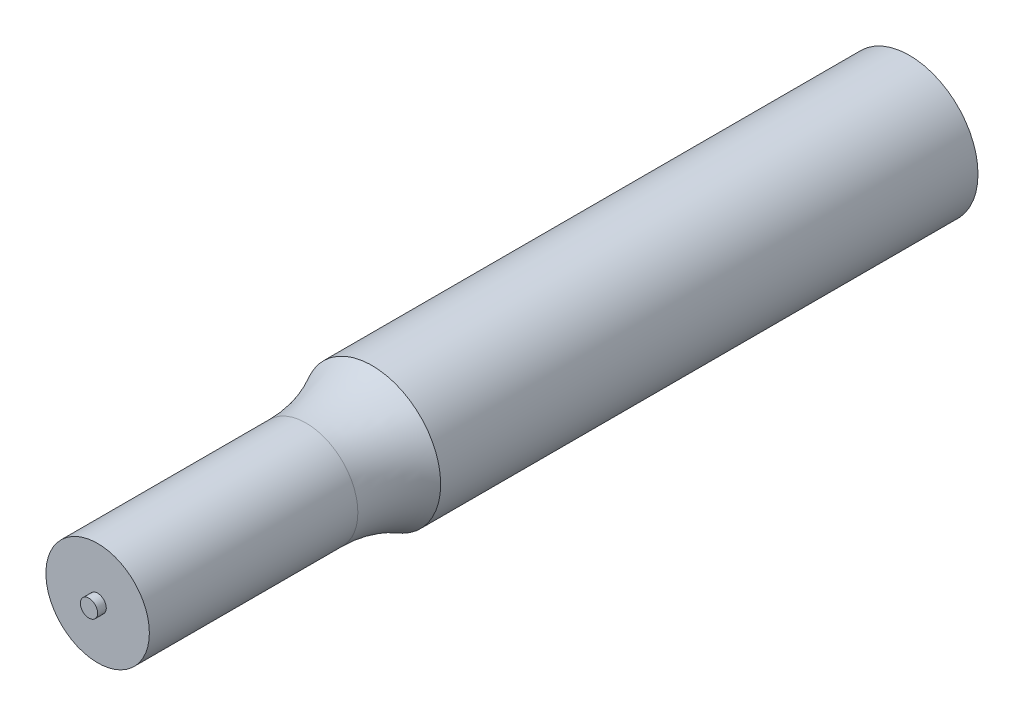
ISO-10303-21;
HEADER;
FILE_DESCRIPTION(('STEP AP214'),'2;1');
FILE_NAME('part.step','',(''),(''),'','','');
FILE_SCHEMA(('AUTOMOTIVE_DESIGN { 1 0 10303 214 1 1 1 1 }'));
ENDSEC;
DATA;
#1=APPLICATION_CONTEXT('core data for automotive mechanical design processes');
#2=APPLICATION_PROTOCOL_DEFINITION('international standard','automotive_design',2000,#1);
#3=PRODUCT_CONTEXT('',#1,'mechanical');
#4=PRODUCT('Part','Part','',(#3));
#5=PRODUCT_RELATED_PRODUCT_CATEGORY('part','',(#4));
#6=PRODUCT_DEFINITION_FORMATION('','',#4);
#7=PRODUCT_DEFINITION_CONTEXT('part definition',#1,'design');
#8=PRODUCT_DEFINITION('design','',#6,#7);
#9=PRODUCT_DEFINITION_SHAPE('','',#8);
#10=(LENGTH_UNIT() NAMED_UNIT(*) SI_UNIT(.MILLI.,.METRE.));
#11=(NAMED_UNIT(*) PLANE_ANGLE_UNIT() SI_UNIT($,.RADIAN.));
#12=(NAMED_UNIT(*) SI_UNIT($,.STERADIAN.) SOLID_ANGLE_UNIT());
#13=UNCERTAINTY_MEASURE_WITH_UNIT(LENGTH_MEASURE(1.E-05),#10,'distance_accuracy_value','');
#14=(GEOMETRIC_REPRESENTATION_CONTEXT(3) GLOBAL_UNCERTAINTY_ASSIGNED_CONTEXT((#13)) GLOBAL_UNIT_ASSIGNED_CONTEXT((#10,
#11,#12)) REPRESENTATION_CONTEXT('',''));
#15=CARTESIAN_POINT('',(0.,0.,0.));
#16=DIRECTION('',(0.,0.,1.));
#17=DIRECTION('',(1.,0.,0.));
#18=AXIS2_PLACEMENT_3D('',#15,#16,#17);
#19=CARTESIAN_POINT('',(-6.35,0.,6.35));
#20=DIRECTION('',(0.,0.,1.));
#21=DIRECTION('',(1.,0.,0.));
#22=AXIS2_PLACEMENT_3D('',#19,#20,#21);
#23=PLANE('',#22);
#24=CARTESIAN_POINT('',(0.,0.,6.35));
#25=DIRECTION('',(0.,0.,1.));
#26=DIRECTION('',(1.,0.,0.));
#27=AXIS2_PLACEMENT_3D('',#24,#25,#26);
#28=CIRCLE('',#27,6.35);
#29=CARTESIAN_POINT('',(6.35,0.,6.35));
#30=VERTEX_POINT('',#29);
#31=EDGE_CURVE('E64',#30,#30,#28,.T.);
#32=ORIENTED_EDGE('',*,*,#31,.F.);
#33=EDGE_LOOP('',(#32));
#34=FACE_BOUND('',#33,.T.);
#35=ADVANCED_FACE('F41',(#34),#23,.F.);
#36=CARTESIAN_POINT('',(0.,0.,43.5171681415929));
#37=DIRECTION('',(0.,0.,1.));
#38=DIRECTION('',(1.,0.,0.));
#39=AXIS2_PLACEMENT_3D('',#36,#37,#38);
#40=CYLINDRICAL_SURFACE('',#39,6.35);
#41=CARTESIAN_POINT('',(-4.84267088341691,-4.10743700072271,25.179099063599));
#42=CARTESIAN_POINT('',(-4.91031116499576,-4.02766520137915,24.7923213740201));
#43=CARTESIAN_POINT('',(-4.97622022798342,-3.94598660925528,24.4056305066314));
#44=CARTESIAN_POINT('',(-5.10457037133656,-3.77849789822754,23.6325148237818));
#45=CARTESIAN_POINT('',(-5.16701100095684,-3.69268724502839,23.246090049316));
#46=CARTESIAN_POINT('',(-5.28869128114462,-3.51621627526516,22.471853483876));
#47=CARTESIAN_POINT('',(-5.3479142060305,-3.42553473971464,22.0840438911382));
#48=CARTESIAN_POINT('',(-5.46281264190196,-3.23916217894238,21.3091382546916));
#49=CARTESIAN_POINT('',(-5.51848847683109,-3.1434716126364,20.9220421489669));
#50=CARTESIAN_POINT('',(-5.62775930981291,-2.94349561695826,20.1381975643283));
#51=CARTESIAN_POINT('',(-5.68125471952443,-2.83904602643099,19.7414769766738));
#52=CARTESIAN_POINT('',(-5.78445697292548,-2.62240574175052,18.9495188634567));
#53=CARTESIAN_POINT('',(-5.83416278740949,-2.51021296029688,18.5542817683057));
#54=CARTESIAN_POINT('',(-5.90576107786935,-2.33419370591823,17.9638277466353));
#55=CARTESIAN_POINT('',(-5.9291108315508,-2.27429911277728,17.7676144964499));
#56=CARTESIAN_POINT('',(-5.9748282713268,-2.15133460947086,17.3760731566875));
#57=CARTESIAN_POINT('',(-5.99719599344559,-2.08826481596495,17.1807450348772));
#58=CARTESIAN_POINT('',(-6.04091673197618,-1.95819561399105,16.7913811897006));
#59=CARTESIAN_POINT('',(-6.06227019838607,-1.89119797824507,16.5973449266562));
#60=CARTESIAN_POINT('',(-6.10393304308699,-1.75208332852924,16.2110122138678));
#61=CARTESIAN_POINT('',(-6.12424257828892,-1.67996708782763,16.0187155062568));
#62=CARTESIAN_POINT('',(-6.15380231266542,-1.56675228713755,15.7329471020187));
#63=CARTESIAN_POINT('',(-6.16347241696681,-1.52831758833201,15.63846410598));
#64=CARTESIAN_POINT('',(-6.1825245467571,-1.4493256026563,15.450339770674));
#65=CARTESIAN_POINT('',(-6.19190652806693,-1.40876799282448,15.3566985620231));
#66=CARTESIAN_POINT('',(-6.21036679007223,-1.32502361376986,15.1704738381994));
#67=CARTESIAN_POINT('',(-6.21944483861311,-1.28183490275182,15.0778911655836));
#68=CARTESIAN_POINT('',(-6.23725256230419,-1.19216789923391,14.8943241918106));
#69=CARTESIAN_POINT('',(-6.24598231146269,-1.1456903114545,14.8033395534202));
#70=CARTESIAN_POINT('',(-6.26502899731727,-1.03713912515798,14.6026879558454));
#71=CARTESIAN_POINT('',(-6.27524324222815,-0.973951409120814,14.4935938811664));
#72=CARTESIAN_POINT('',(-6.28993321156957,-0.872007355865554,14.3346767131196));
#73=CARTESIAN_POINT('',(-6.29471851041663,-0.836885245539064,14.2825598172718));
#74=CARTESIAN_POINT('',(-6.30403025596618,-0.76359266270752,14.1805061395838));
#75=CARTESIAN_POINT('',(-6.30855685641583,-0.725424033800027,14.1305680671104));
#76=CARTESIAN_POINT('',(-6.3167242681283,-0.650185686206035,14.0399236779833));
#77=CARTESIAN_POINT('',(-6.32040505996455,-0.613575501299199,13.9988438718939));
#78=CARTESIAN_POINT('',(-6.32741951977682,-0.536439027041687,13.9201768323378));
#79=CARTESIAN_POINT('',(-6.33075208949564,-0.495901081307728,13.8826006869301));
#80=CARTESIAN_POINT('',(-6.33694554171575,-0.409326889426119,13.8124695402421));
#81=CARTESIAN_POINT('',(-6.33979699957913,-0.363205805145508,13.7800155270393));
#82=CARTESIAN_POINT('',(-6.34463224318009,-0.265487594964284,13.7248093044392));
#83=CARTESIAN_POINT('',(-6.34662196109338,-0.213931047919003,13.7019907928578));
#84=CARTESIAN_POINT('',(-6.34875500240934,-0.129467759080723,13.6774958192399));
#85=CARTESIAN_POINT('',(-6.34932391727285,-0.097991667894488,13.6709525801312));
#86=CARTESIAN_POINT('',(-6.34998629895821,-0.0343716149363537,13.6633332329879));
#87=CARTESIAN_POINT('',(-6.35008005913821,-0.00222807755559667,13.6622537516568));
#88=CARTESIAN_POINT('',(-6.34978056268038,0.0617275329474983,13.6656997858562));
#89=CARTESIAN_POINT('',(-6.34938755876,0.0935397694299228,13.6702223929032));
#90=CARTESIAN_POINT('',(-6.34816036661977,0.156013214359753,13.6843262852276));
#91=CARTESIAN_POINT('',(-6.34732566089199,0.186673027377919,13.6939135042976));
#92=CARTESIAN_POINT('',(-6.34482209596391,0.260065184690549,13.7226150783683));
#93=CARTESIAN_POINT('',(-6.34294612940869,0.301858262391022,13.7440834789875));
#94=CARTESIAN_POINT('',(-6.33864739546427,0.38165159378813,13.793095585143));
#95=CARTESIAN_POINT('',(-6.33622323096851,0.419641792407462,13.8206548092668));
#96=CARTESIAN_POINT('',(-6.33048242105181,0.499390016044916,13.8856462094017));
#97=CARTESIAN_POINT('',(-6.32708403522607,0.540416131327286,13.9239538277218));
#98=CARTESIAN_POINT('',(-6.31991582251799,0.618632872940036,14.0043143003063));
#99=CARTESIAN_POINT('',(-6.31614532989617,0.655816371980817,14.0463738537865));
#100=CARTESIAN_POINT('',(-6.30831294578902,0.727315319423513,14.1332452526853));
#101=CARTESIAN_POINT('',(-6.30424941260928,0.761611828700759,14.1780723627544));
#102=CARTESIAN_POINT('',(-6.29591643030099,0.827671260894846,14.2694579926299));
#103=CARTESIAN_POINT('',(-6.29164716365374,0.859436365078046,14.3160149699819));
#104=CARTESIAN_POINT('',(-6.27903822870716,0.948507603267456,14.4526950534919));
#105=CARTESIAN_POINT('',(-6.27047768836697,1.00320772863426,14.5444903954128));
#106=CARTESIAN_POINT('',(-6.25289089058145,1.10753607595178,14.7308978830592));
#107=CARTESIAN_POINT('',(-6.24386430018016,1.15716059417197,14.8255120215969));
#108=CARTESIAN_POINT('',(-6.22540152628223,1.2526961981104,15.01681191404));
#109=CARTESIAN_POINT('',(-6.21596447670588,1.29859878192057,15.1135018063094));
#110=CARTESIAN_POINT('',(-6.1967416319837,1.38742561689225,15.3082116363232));
#111=CARTESIAN_POINT('',(-6.18695578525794,1.43034942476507,15.4062317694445));
#112=CARTESIAN_POINT('',(-6.15702657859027,1.55595508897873,15.7026425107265));
#113=CARTESIAN_POINT('',(-6.13639643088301,1.63504712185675,15.9025024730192));
#114=CARTESIAN_POINT('',(-6.0939967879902,1.78657264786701,16.3042250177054));
#115=CARTESIAN_POINT('',(-6.0722290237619,1.85901581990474,16.5060841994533));
#116=CARTESIAN_POINT('',(-6.03036939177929,1.99029543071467,16.8860423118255));
#117=CARTESIAN_POINT('',(-6.01040779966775,2.04970121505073,17.0639597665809));
#118=CARTESIAN_POINT('',(-5.9696550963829,2.1655203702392,17.4206719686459));
#119=CARTESIAN_POINT('',(-5.94886396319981,2.22193366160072,17.5994667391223));
#120=CARTESIAN_POINT('',(-5.88526310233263,2.38751102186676,18.1368946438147));
#121=CARTESIAN_POINT('',(-5.84123182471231,2.49299442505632,18.4965176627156));
#122=CARTESIAN_POINT('',(-5.74991915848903,2.69692067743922,19.2179005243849));
#123=CARTESIAN_POINT('',(-5.7026330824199,2.79535293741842,19.5796627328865));
#124=CARTESIAN_POINT('',(-5.60490949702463,2.98647037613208,20.3042400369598));
#125=CARTESIAN_POINT('',(-5.55447226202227,3.0791560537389,20.6670550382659));
#126=CARTESIAN_POINT('',(-5.45303116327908,3.25526543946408,21.3755236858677));
#127=CARTESIAN_POINT('',(-5.40217781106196,3.33892049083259,21.7211416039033));
#128=CARTESIAN_POINT('',(-5.29765509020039,3.50239341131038,22.4128681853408));
#129=CARTESIAN_POINT('',(-5.24398564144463,3.58221117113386,22.7589768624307));
#130=CARTESIAN_POINT('',(-5.13398766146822,3.73814880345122,23.4506312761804));
#131=CARTESIAN_POINT('',(-5.07766643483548,3.81427778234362,23.7961761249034));
#132=CARTESIAN_POINT('',(-4.9622484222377,3.96326100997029,24.487489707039));
#133=CARTESIAN_POINT('',(-4.90315177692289,4.03611542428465,24.8332584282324));
#134=CARTESIAN_POINT('',(-4.84267088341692,4.10743700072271,25.179099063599));
#135=B_SPLINE_CURVE_WITH_KNOTS('',3,(#41,#42,#43,#44,#45,#46,#47,#48,#49,#50,#51,#52,#53,#54,
#55,#56,#57,#58,#59,#60,#61,#62,#63,#64,#65,#66,#67,#68,#69,#70,#71,#72,#73,#74,#75,#76,#77,#78,
#79,#80,#81,#82,#83,#84,#85,#86,#87,#88,#89,#90,#91,#92,#93,#94,#95,#96,#97,#98,#99,#100,#101,
#102,#103,#104,#105,#106,#107,#108,#109,#110,#111,#112,#113,#114,#115,#116,#117,#118,#119,#120,
#121,#122,#123,#124,#125,#126,#127,#128,#129,#130,#131,#132,#133,#134),.UNSPECIFIED.,.F.,.F.,(4,
2,2,2,2,2,2,2,2,2,2,2,2,2,2,2,2,2,2,2,2,2,2,2,2,2,2,2,2,2,2,2,2,2,2,2,2,2,2,2,2,2,2,2,2,2,4),
(0.,1.20200424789,2.40416434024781,3.61207023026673,4.81986564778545,6.06093657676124,
7.3023433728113,7.92174916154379,8.54113220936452,9.16023783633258,9.77925013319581,
10.0866059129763,10.3940085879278,10.7016409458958,11.0092075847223,11.3882604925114,
11.5772698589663,11.7661657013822,11.9314380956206,12.0972169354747,12.2659389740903,
12.4334803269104,12.5295220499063,12.6255044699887,12.7214370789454,12.8174823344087,
12.9577382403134,13.0983557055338,13.2666724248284,13.4352959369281,13.6049511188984,
13.7744584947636,14.0957863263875,14.4173469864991,14.7396226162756,15.0619461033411,
15.7095337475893,16.3561632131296,16.9220256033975,17.4879030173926,18.6198287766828,
19.7534202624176,20.8869132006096,21.9645270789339,23.0421716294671,24.1170039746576,
25.1917819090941),.UNSPECIFIED.);
#136=CARTESIAN_POINT('',(-4.84270585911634,-4.10739576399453,25.178899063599));
#137=VERTEX_POINT('',#136);
#138=CARTESIAN_POINT('',(-4.84270585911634,4.10739576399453,25.178899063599));
#139=VERTEX_POINT('',#138);
#140=EDGE_CURVE('E53',#137,#139,#135,.T.);
#141=ORIENTED_EDGE('',*,*,#140,.T.);
#142=CARTESIAN_POINT('',(-4.84274083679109,4.10735452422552,25.178699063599));
#143=CARTESIAN_POINT('',(-4.82778505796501,4.12498432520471,25.2642011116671));
#144=CARTESIAN_POINT('',(-4.81391554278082,4.14114605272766,25.3501839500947));
#145=CARTESIAN_POINT('',(-4.78843682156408,4.17058235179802,25.5229713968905));
#146=CARTESIAN_POINT('',(-4.77682752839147,4.18385703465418,25.6097759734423));
#147=CARTESIAN_POINT('',(-4.74552601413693,4.21941907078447,25.8711726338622));
#148=CARTESIAN_POINT('',(-4.72935149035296,4.23745445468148,26.0467967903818));
#149=CARTESIAN_POINT('',(-4.70687228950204,4.26240911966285,26.3992920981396));
#150=CARTESIAN_POINT('',(-4.70055959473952,4.2693374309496,26.5761621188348));
#151=CARTESIAN_POINT('',(-4.69795117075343,4.27220782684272,26.9300713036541));
#152=CARTESIAN_POINT('',(-4.70165544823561,4.26814990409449,27.1071104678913));
#153=CARTESIAN_POINT('',(-4.71897998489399,4.24898741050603,27.4601380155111));
#154=CARTESIAN_POINT('',(-4.73260227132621,4.23388058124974,27.6361261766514));
#155=CARTESIAN_POINT('',(-4.76937959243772,4.19240808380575,27.9857641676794));
#156=CARTESIAN_POINT('',(-4.7925344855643,4.16604258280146,28.1594140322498));
#157=CARTESIAN_POINT('',(-4.84774007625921,4.10167211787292,28.5032635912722));
#158=CARTESIAN_POINT('',(-4.87979819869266,4.06365743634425,28.6734602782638));
#159=CARTESIAN_POINT('',(-4.95186919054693,3.97551642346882,29.0089658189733));
#160=CARTESIAN_POINT('',(-4.99188180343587,3.9253904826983,29.174274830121));
#161=CARTESIAN_POINT('',(-5.07839446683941,3.81279638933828,29.4976725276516));
#162=CARTESIAN_POINT('',(-5.12485267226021,3.7504068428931,29.6557996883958));
#163=CARTESIAN_POINT('',(-5.22300975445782,3.61245558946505,29.9645528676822));
#164=CARTESIAN_POINT('',(-5.27470937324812,3.53689201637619,30.1151778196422));
#165=CARTESIAN_POINT('',(-5.38153845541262,3.37211531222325,30.4071255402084));
#166=CARTESIAN_POINT('',(-5.43666145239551,3.28292747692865,30.5484648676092));
#167=CARTESIAN_POINT('',(-5.54839270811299,3.09034366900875,30.8203586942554));
#168=CARTESIAN_POINT('',(-5.6050001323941,2.98695554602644,30.9509190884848));
#169=CARTESIAN_POINT('',(-5.73575781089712,2.72958441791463,31.2398599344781));
#170=CARTESIAN_POINT('',(-5.80964177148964,2.57006859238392,31.3935253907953));
#171=CARTESIAN_POINT('',(-5.94999250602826,2.22586739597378,31.6735119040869));
#172=CARTESIAN_POINT('',(-6.01646933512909,2.04121692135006,31.7998702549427));
#173=CARTESIAN_POINT('',(-6.12661056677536,1.67853475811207,32.0033402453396));
#174=CARTESIAN_POINT('',(-6.17220015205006,1.5036488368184,32.0849920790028));
#175=CARTESIAN_POINT('',(-6.24945896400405,1.14066295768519,32.2212052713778));
#176=CARTESIAN_POINT('',(-6.28113389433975,0.952568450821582,32.2757777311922));
#177=CARTESIAN_POINT('',(-6.32759988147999,0.567245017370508,32.3552820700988));
#178=CARTESIAN_POINT('',(-6.34231672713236,0.36997984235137,32.3800836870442));
#179=CARTESIAN_POINT('',(-6.35303742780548,-0.0264934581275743,32.3981855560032));
#180=CARTESIAN_POINT('',(-6.34904531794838,-0.225701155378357,32.3914926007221));
#181=CARTESIAN_POINT('',(-6.32381747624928,-0.604217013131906,32.348741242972));
#182=CARTESIAN_POINT('',(-6.30392380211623,-0.783881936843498,32.3149677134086));
#183=CARTESIAN_POINT('',(-6.25035432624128,-1.13447691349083,32.2225274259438));
#184=CARTESIAN_POINT('',(-6.2166775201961,-1.30540632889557,32.163858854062));
#185=CARTESIAN_POINT('',(-6.13661815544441,-1.64181908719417,32.0211252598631));
#186=CARTESIAN_POINT('',(-6.08976678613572,-1.80678298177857,31.9361083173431));
#187=CARTESIAN_POINT('',(-5.98761405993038,-2.12092270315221,31.7447907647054));
#188=CARTESIAN_POINT('',(-5.93230913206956,-2.27009181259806,31.6384811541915));
#189=CARTESIAN_POINT('',(-5.80805712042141,-2.57287640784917,31.3900563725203));
#190=CARTESIAN_POINT('',(-5.73831546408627,-2.72370504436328,31.2449535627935));
#191=CARTESIAN_POINT('',(-5.597501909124,-3.00248431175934,30.9348584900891));
#192=CARTESIAN_POINT('',(-5.52642919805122,-3.13042043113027,30.7698537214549));
#193=CARTESIAN_POINT('',(-5.37258921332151,-3.3889544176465,30.3867779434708));
#194=CARTESIAN_POINT('',(-5.29055334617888,-3.51432090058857,30.1648879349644));
#195=CARTESIAN_POINT('',(-5.13756021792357,-3.73443399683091,29.7027754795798));
#196=CARTESIAN_POINT('',(-5.06661028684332,-3.82916039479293,29.462541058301));
#197=CARTESIAN_POINT('',(-4.96612833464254,-3.95774564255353,29.0680319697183));
#198=CARTESIAN_POINT('',(-4.93140309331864,-4.00077389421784,28.9179624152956));
#199=CARTESIAN_POINT('',(-4.86853784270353,-4.07704497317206,28.6139655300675));
#200=CARTESIAN_POINT('',(-4.84039854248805,-4.11028674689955,28.4600377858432));
#201=CARTESIAN_POINT('',(-4.7913747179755,-4.16733029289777,28.1492190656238));
#202=CARTESIAN_POINT('',(-4.77049440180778,-4.19112659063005,27.9923264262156));
#203=CARTESIAN_POINT('',(-4.73649217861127,-4.22951508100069,27.6765841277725));
#204=CARTESIAN_POINT('',(-4.72337063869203,-4.24410683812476,27.5177343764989));
#205=CARTESIAN_POINT('',(-4.70387409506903,-4.26571477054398,27.1758262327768));
#206=CARTESIAN_POINT('',(-4.69875640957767,-4.27132212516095,26.9926040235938));
#207=CARTESIAN_POINT('',(-4.69926159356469,-4.27076530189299,26.6261810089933));
#208=CARTESIAN_POINT('',(-4.70488591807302,-4.26459952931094,26.4429802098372));
#209=CARTESIAN_POINT('',(-4.72672167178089,-4.24038596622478,26.0778195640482));
#210=CARTESIAN_POINT('',(-4.7429417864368,-4.22232842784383,25.8958608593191));
#211=CARTESIAN_POINT('',(-4.77483486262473,-4.18613195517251,25.6250866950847));
#212=CARTESIAN_POINT('',(-4.78672780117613,-4.17254644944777,25.5351811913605));
#213=CARTESIAN_POINT('',(-4.81293920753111,-4.14228327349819,25.3562452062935));
#214=CARTESIAN_POINT('',(-4.8272577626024,-4.12560549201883,25.2672147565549));
#215=CARTESIAN_POINT('',(-4.84274083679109,-4.10735452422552,25.178699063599));
#216=B_SPLINE_CURVE_WITH_KNOTS('',3,(#142,#143,#144,#145,#146,#147,#148,#149,#150,#151,#152,
#153,#154,#155,#156,#157,#158,#159,#160,#161,#162,#163,#164,#165,#166,#167,#168,#169,#170,#171,
#172,#173,#174,#175,#176,#177,#178,#179,#180,#181,#182,#183,#184,#185,#186,#187,#188,#189,#190,
#191,#192,#193,#194,#195,#196,#197,#198,#199,#200,#201,#202,#203,#204,#205,#206,#207,#208,#209,
#210,#211,#212,#213,#214,#215),.UNSPECIFIED.,.F.,.F.,(4,2,2,2,2,2,2,2,2,2,2,2,2,2,2,2,2,2,2,2,2,
2,2,2,2,2,2,2,2,2,2,2,2,2,2,2,4),(0.,0.265674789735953,0.531339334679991,1.06251621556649,
1.59326102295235,2.12400618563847,2.65485986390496,3.18570565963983,3.71699549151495,
4.24826819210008,4.77624054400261,5.30428774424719,5.83136619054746,6.35815444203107,
7.05583513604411,7.75255688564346,8.34499992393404,8.93719989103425,9.53198168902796,
10.1266352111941,10.6758124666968,11.2250297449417,11.7970130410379,12.3692386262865,
13.0286701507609,13.6885182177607,14.4888375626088,15.2896838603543,15.7690530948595,
16.2484739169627,16.7281722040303,17.2078931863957,17.7573186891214,18.3068186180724,
18.856769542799,19.1317951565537,19.4068306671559),.UNSPECIFIED.);
#217=EDGE_CURVE('E11',#139,#137,#216,.T.);
#218=ORIENTED_EDGE('',*,*,#217,.T.);
#219=EDGE_LOOP('',(#141,#218));
#220=FACE_BOUND('',#219,.T.);
#221=CARTESIAN_POINT('',(0.,0.,56.0832));
#222=DIRECTION('',(0.,0.,1.));
#223=DIRECTION('',(1.,0.,0.));
#224=AXIS2_PLACEMENT_3D('',#221,#222,#223);
#225=CIRCLE('',#224,6.34999999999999);
#226=CARTESIAN_POINT('',(6.34999999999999,0.,56.0832));
#227=VERTEX_POINT('',#226);
#228=EDGE_CURVE('E76',#227,#227,#225,.T.);
#229=ORIENTED_EDGE('',*,*,#228,.F.);
#230=EDGE_LOOP('',(#229));
#231=FACE_BOUND('',#230,.T.);
#232=ORIENTED_EDGE('',*,*,#31,.T.);
#233=EDGE_LOOP('',(#232));
#234=FACE_BOUND('',#233,.T.);
#235=ADVANCED_FACE('F69',(#220,#231,#234),#40,.T.);
#236=CARTESIAN_POINT('',(0.,0.,62.1854277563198));
#237=DIRECTION('',(0.,0.,1.));
#238=DIRECTION('',(1.,0.,0.));
#239=AXIS2_PLACEMENT_3D('',#236,#237,#238);
#240=TOROIDAL_SURFACE('',#239,17.4879,12.7);
#241=CARTESIAN_POINT('',(0.,0.,62.1854277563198));
#242=DIRECTION('',(0.,0.,1.));
#243=DIRECTION('',(1.,0.,0.));
#244=AXIS2_PLACEMENT_3D('',#241,#242,#243);
#245=CIRCLE('',#244,4.78789999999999);
#246=CARTESIAN_POINT('',(4.78789999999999,0.,62.1854277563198));
#247=VERTEX_POINT('',#246);
#248=EDGE_CURVE('E81',#247,#247,#245,.T.);
#249=ORIENTED_EDGE('',*,*,#248,.F.);
#250=EDGE_LOOP('',(#249));
#251=FACE_BOUND('',#250,.T.);
#252=ORIENTED_EDGE('',*,*,#228,.T.);
#253=EDGE_LOOP('',(#252));
#254=FACE_BOUND('',#253,.T.);
#255=ADVANCED_FACE('F72',(#251,#254),#240,.F.);
#256=CARTESIAN_POINT('',(0.,0.,43.5171681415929));
#257=DIRECTION('',(0.,0.,1.));
#258=DIRECTION('',(1.,0.,0.));
#259=AXIS2_PLACEMENT_3D('',#256,#257,#258);
#260=CYLINDRICAL_SURFACE('',#259,4.78789999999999);
#261=CARTESIAN_POINT('',(0.,0.,81.4832));
#262=DIRECTION('',(0.,0.,1.));
#263=DIRECTION('',(1.,0.,0.));
#264=AXIS2_PLACEMENT_3D('',#261,#262,#263);
#265=CIRCLE('',#264,4.78789999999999);
#266=CARTESIAN_POINT('',(4.78789999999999,0.,81.4832));
#267=VERTEX_POINT('',#266);
#268=EDGE_CURVE('E87',#267,#267,#265,.T.);
#269=ORIENTED_EDGE('',*,*,#268,.F.);
#270=EDGE_LOOP('',(#269));
#271=FACE_BOUND('',#270,.T.);
#272=ORIENTED_EDGE('',*,*,#248,.T.);
#273=EDGE_LOOP('',(#272));
#274=FACE_BOUND('',#273,.T.);
#275=ADVANCED_FACE('F111',(#271,#274),#260,.T.);
#276=CARTESIAN_POINT('',(0.,0.,81.4832));
#277=DIRECTION('',(0.,0.,-1.));
#278=DIRECTION('',(-1.,0.,0.));
#279=AXIS2_PLACEMENT_3D('',#276,#277,#278);
#280=PLANE('',#279);
#281=CARTESIAN_POINT('',(0.,0.,81.4832));
#282=DIRECTION('',(0.,0.,-1.));
#283=DIRECTION('',(-1.,0.,0.));
#284=AXIS2_PLACEMENT_3D('',#281,#282,#283);
#285=CIRCLE('',#284,0.800100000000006);
#286=CARTESIAN_POINT('',(-0.80009999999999,0.,81.4832));
#287=VERTEX_POINT('',#286);
#288=EDGE_CURVE('E85',#287,#287,#285,.T.);
#289=ORIENTED_EDGE('',*,*,#288,.T.);
#290=EDGE_LOOP('',(#289));
#291=FACE_BOUND('',#290,.T.);
#292=ORIENTED_EDGE('',*,*,#268,.T.);
#293=EDGE_LOOP('',(#292));
#294=FACE_BOUND('',#293,.T.);
#295=ADVANCED_FACE('F104',(#291,#294),#280,.F.);
#296=CARTESIAN_POINT('',(0.,0.,0.));
#297=DIRECTION('',(0.,0.,-1.));
#298=DIRECTION('',(-1.,0.,0.));
#299=AXIS2_PLACEMENT_3D('',#296,#297,#298);
#300=CYLINDRICAL_SURFACE('',#299,0.800100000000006);
#301=CARTESIAN_POINT('',(0.,0.,82.2833));
#302=DIRECTION('',(0.,0.,-1.));
#303=DIRECTION('',(-1.,0.,0.));
#304=AXIS2_PLACEMENT_3D('',#301,#302,#303);
#305=CIRCLE('',#304,0.800100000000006);
#306=CARTESIAN_POINT('',(-0.80009999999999,0.,82.2833));
#307=VERTEX_POINT('',#306);
#308=EDGE_CURVE('E67',#307,#307,#305,.T.);
#309=ORIENTED_EDGE('',*,*,#308,.T.);
#310=EDGE_LOOP('',(#309));
#311=FACE_BOUND('',#310,.T.);
#312=ORIENTED_EDGE('',*,*,#288,.F.);
#313=EDGE_LOOP('',(#312));
#314=FACE_BOUND('',#313,.T.);
#315=ADVANCED_FACE('F101',(#311,#314),#300,.T.);
#316=CARTESIAN_POINT('',(0.,0.,82.2833));
#317=DIRECTION('',(0.,0.,1.));
#318=DIRECTION('',(1.,0.,0.));
#319=AXIS2_PLACEMENT_3D('',#316,#317,#318);
#320=PLANE('',#319);
#321=ORIENTED_EDGE('',*,*,#308,.F.);
#322=EDGE_LOOP('',(#321));
#323=FACE_BOUND('',#322,.T.);
#324=ADVANCED_FACE('F100',(#323),#320,.T.);
#325=CARTESIAN_POINT('',(-9.398,0.,26.8224));
#326=DIRECTION('',(0.,0.,-1.));
#327=DIRECTION('',(-1.,0.,0.));
#328=AXIS2_PLACEMENT_3D('',#325,#326,#327);
#329=SPHERICAL_SURFACE('',#328,6.35);
#330=CARTESIAN_POINT('',(-9.398,0.,25.178899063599));
#331=DIRECTION('',(0.,0.,-1.));
#332=DIRECTION('',(-1.,0.,0.));
#333=AXIS2_PLACEMENT_3D('',#330,#331,#332);
#334=CIRCLE('',#333,6.1336289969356);
#335=EDGE_CURVE('E59',#139,#137,#334,.T.);
#336=ORIENTED_EDGE('',*,*,#335,.T.);
#337=ORIENTED_EDGE('',*,*,#217,.F.);
#338=EDGE_LOOP('',(#336,#337));
#339=FACE_BOUND('',#338,.T.);
#340=ADVANCED_FACE('F66',(#339),#329,.F.);
#341=CARTESIAN_POINT('',(-9.398,0.,2.28788401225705));
#342=DIRECTION('',(0.,0.,1.));
#343=DIRECTION('',(1.,0.,0.));
#344=AXIS2_PLACEMENT_3D('',#341,#342,#343);
#345=CONICAL_SURFACE('',#344,0.,0.261799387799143);
#346=ORIENTED_EDGE('',*,*,#335,.F.);
#347=ORIENTED_EDGE('',*,*,#140,.F.);
#348=EDGE_LOOP('',(#346,#347));
#349=FACE_BOUND('',#348,.T.);
#350=ADVANCED_FACE('F62',(#349),#345,.F.);
#351=CLOSED_SHELL('',(#35,#235,#255,#275,#295,#315,#324,#340,#350));
#352=MANIFOLD_SOLID_BREP('B2',#351);
#353=ADVANCED_BREP_SHAPE_REPRESENTATION('',(#18,#352),#14);
#354=SHAPE_DEFINITION_REPRESENTATION(#9,#353);
ENDSEC;
END-ISO-10303-21;
